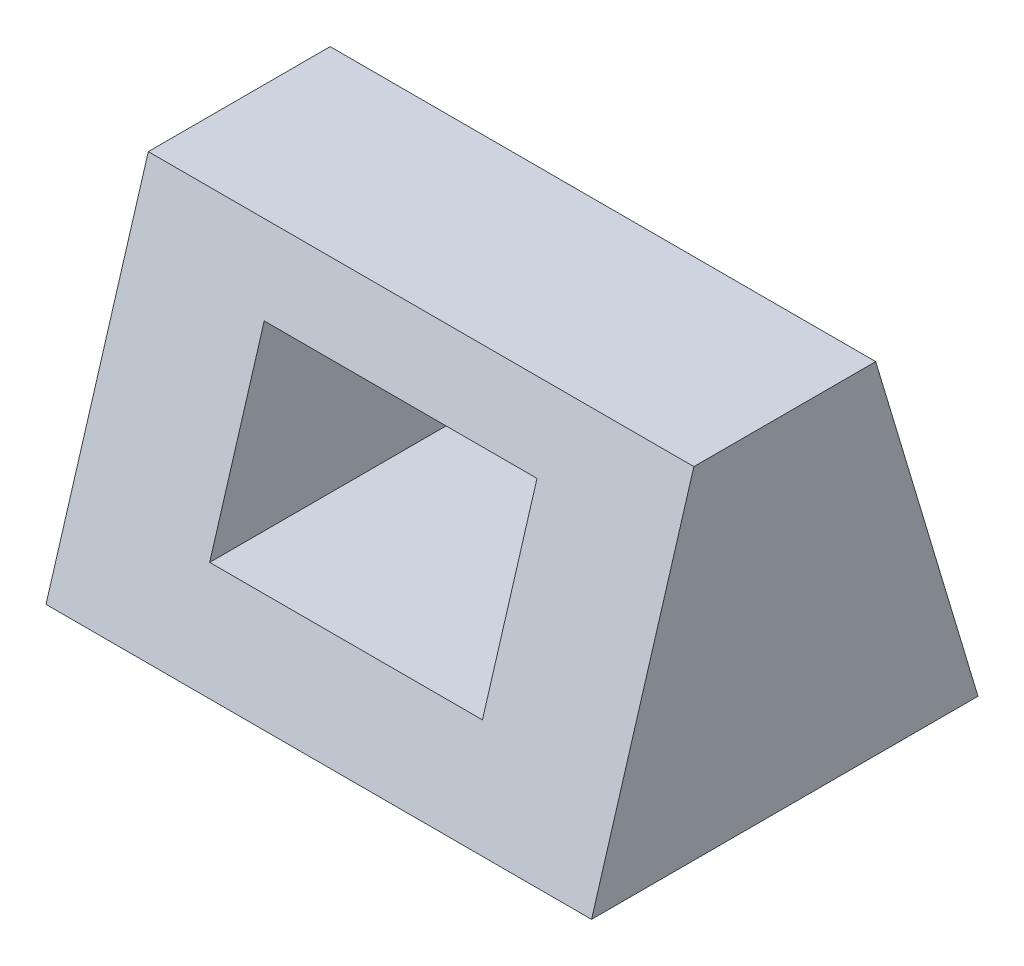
ISO-10303-21;
HEADER;
FILE_DESCRIPTION(('STEP AP214'),'2;1');
FILE_NAME('part.step','',(''),(''),'','','');
FILE_SCHEMA(('AUTOMOTIVE_DESIGN { 1 0 10303 214 1 1 1 1 }'));
ENDSEC;
DATA;
#1=APPLICATION_CONTEXT('core data for automotive mechanical design processes');
#2=APPLICATION_PROTOCOL_DEFINITION('international standard','automotive_design',2000,#1);
#3=PRODUCT_CONTEXT('',#1,'mechanical');
#4=PRODUCT('Part','Part','',(#3));
#5=PRODUCT_RELATED_PRODUCT_CATEGORY('part','',(#4));
#6=PRODUCT_DEFINITION_FORMATION('','',#4);
#7=PRODUCT_DEFINITION_CONTEXT('part definition',#1,'design');
#8=PRODUCT_DEFINITION('design','',#6,#7);
#9=PRODUCT_DEFINITION_SHAPE('','',#8);
#10=(LENGTH_UNIT() NAMED_UNIT(*) SI_UNIT(.MILLI.,.METRE.));
#11=(NAMED_UNIT(*) PLANE_ANGLE_UNIT() SI_UNIT($,.RADIAN.));
#12=(NAMED_UNIT(*) SI_UNIT($,.STERADIAN.) SOLID_ANGLE_UNIT());
#13=UNCERTAINTY_MEASURE_WITH_UNIT(LENGTH_MEASURE(1.E-05),#10,'distance_accuracy_value','');
#14=(GEOMETRIC_REPRESENTATION_CONTEXT(3) GLOBAL_UNCERTAINTY_ASSIGNED_CONTEXT((#13)) GLOBAL_UNIT_ASSIGNED_CONTEXT((#10,
#11,#12)) REPRESENTATION_CONTEXT('',''));
#15=CARTESIAN_POINT('',(0.,0.,0.));
#16=DIRECTION('',(0.,0.,1.));
#17=DIRECTION('',(1.,0.,0.));
#18=AXIS2_PLACEMENT_3D('',#15,#16,#17);
#19=CARTESIAN_POINT('',(120.,75.,20.));
#20=DIRECTION('',(0.,-0.287347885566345,-0.957826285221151));
#21=DIRECTION('',(0.,0.957826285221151,-0.287347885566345));
#22=AXIS2_PLACEMENT_3D('',#19,#20,#21);
#23=PLANE('',#22);
#24=DIRECTION('',(0.,-0.957826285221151,0.287347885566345));
#25=VECTOR('',#24,1.);
#26=CARTESIAN_POINT('',(0.,75.,20.));
#27=LINE('',#26,#25);
#28=CARTESIAN_POINT('',(0.,75.,20.));
#29=VERTEX_POINT('',#28);
#30=CARTESIAN_POINT('',(0.,0.,42.5));
#31=VERTEX_POINT('',#30);
#32=EDGE_CURVE('E131',#29,#31,#27,.T.);
#33=ORIENTED_EDGE('',*,*,#32,.T.);
#34=DIRECTION('',(-1.,0.,0.));
#35=VECTOR('',#34,1.);
#36=CARTESIAN_POINT('',(120.,0.,42.5));
#37=LINE('',#36,#35);
#38=CARTESIAN_POINT('',(120.,0.,42.5));
#39=VERTEX_POINT('',#38);
#40=EDGE_CURVE('E97',#39,#31,#37,.T.);
#41=ORIENTED_EDGE('',*,*,#40,.F.);
#42=DIRECTION('',(0.,-0.957826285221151,0.287347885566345));
#43=VECTOR('',#42,1.);
#44=CARTESIAN_POINT('',(120.,75.,20.));
#45=LINE('',#44,#43);
#46=CARTESIAN_POINT('',(120.,75.,20.));
#47=VERTEX_POINT('',#46);
#48=EDGE_CURVE('E126',#47,#39,#45,.T.);
#49=ORIENTED_EDGE('',*,*,#48,.F.);
#50=DIRECTION('',(-1.,0.,0.));
#51=VECTOR('',#50,1.);
#52=CARTESIAN_POINT('',(120.,75.,20.));
#53=LINE('',#52,#51);
#54=EDGE_CURVE('E120',#47,#29,#53,.T.);
#55=ORIENTED_EDGE('',*,*,#54,.T.);
#56=EDGE_LOOP('',(#33,#41,#49,#55));
#57=FACE_BOUND('',#56,.T.);
#58=DIRECTION('',(0.,-0.957826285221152,0.287347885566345));
#59=VECTOR('',#58,1.);
#60=CARTESIAN_POINT('',(30.,75.,20.));
#61=LINE('',#60,#59);
#62=CARTESIAN_POINT('',(30.,60.,24.5));
#63=VERTEX_POINT('',#62);
#64=CARTESIAN_POINT('',(30.,20.,36.5));
#65=VERTEX_POINT('',#64);
#66=EDGE_CURVE('E134',#63,#65,#61,.T.);
#67=ORIENTED_EDGE('',*,*,#66,.F.);
#68=DIRECTION('',(-1.,0.,0.));
#69=VECTOR('',#68,1.);
#70=CARTESIAN_POINT('',(120.,60.,24.5));
#71=LINE('',#70,#69);
#72=CARTESIAN_POINT('',(90.,60.,24.5));
#73=VERTEX_POINT('',#72);
#74=EDGE_CURVE('E146',#73,#63,#71,.T.);
#75=ORIENTED_EDGE('',*,*,#74,.F.);
#76=DIRECTION('',(0.,0.957826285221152,-0.287347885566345));
#77=VECTOR('',#76,1.);
#78=CARTESIAN_POINT('',(90.,75.,20.));
#79=LINE('',#78,#77);
#80=CARTESIAN_POINT('',(90.,20.,36.5));
#81=VERTEX_POINT('',#80);
#82=EDGE_CURVE('E104',#81,#73,#79,.T.);
#83=ORIENTED_EDGE('',*,*,#82,.F.);
#84=DIRECTION('',(1.,0.,0.));
#85=VECTOR('',#84,1.);
#86=CARTESIAN_POINT('',(120.,20.,36.5));
#87=LINE('',#86,#85);
#88=EDGE_CURVE('E143',#65,#81,#87,.T.);
#89=ORIENTED_EDGE('',*,*,#88,.F.);
#90=EDGE_LOOP('',(#67,#75,#83,#89));
#91=FACE_BOUND('',#90,.T.);
#92=ADVANCED_FACE('F31',(#57,#91),#23,.F.);
#93=CARTESIAN_POINT('',(120.,0.,-42.5));
#94=DIRECTION('',(0.,-0.287347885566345,0.957826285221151));
#95=DIRECTION('',(0.,-0.957826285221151,-0.287347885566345));
#96=AXIS2_PLACEMENT_3D('',#93,#94,#95);
#97=PLANE('',#96);
#98=DIRECTION('',(0.,0.957826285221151,0.287347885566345));
#99=VECTOR('',#98,1.);
#100=CARTESIAN_POINT('',(0.,0.,-42.5));
#101=LINE('',#100,#99);
#102=CARTESIAN_POINT('',(0.,0.,-42.5));
#103=VERTEX_POINT('',#102);
#104=CARTESIAN_POINT('',(0.,75.,-20.));
#105=VERTEX_POINT('',#104);
#106=EDGE_CURVE('E127',#103,#105,#101,.T.);
#107=ORIENTED_EDGE('',*,*,#106,.T.);
#108=DIRECTION('',(-1.,0.,0.));
#109=VECTOR('',#108,1.);
#110=CARTESIAN_POINT('',(120.,75.,-20.));
#111=LINE('',#110,#109);
#112=CARTESIAN_POINT('',(120.,75.,-20.));
#113=VERTEX_POINT('',#112);
#114=EDGE_CURVE('E117',#113,#105,#111,.T.);
#115=ORIENTED_EDGE('',*,*,#114,.F.);
#116=DIRECTION('',(0.,0.957826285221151,0.287347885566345));
#117=VECTOR('',#116,1.);
#118=CARTESIAN_POINT('',(120.,0.,-42.5));
#119=LINE('',#118,#117);
#120=CARTESIAN_POINT('',(120.,0.,-42.5));
#121=VERTEX_POINT('',#120);
#122=EDGE_CURVE('E136',#121,#113,#119,.T.);
#123=ORIENTED_EDGE('',*,*,#122,.F.);
#124=DIRECTION('',(-1.,0.,0.));
#125=VECTOR('',#124,1.);
#126=CARTESIAN_POINT('',(120.,0.,-42.5));
#127=LINE('',#126,#125);
#128=EDGE_CURVE('E114',#121,#103,#127,.T.);
#129=ORIENTED_EDGE('',*,*,#128,.T.);
#130=EDGE_LOOP('',(#107,#115,#123,#129));
#131=FACE_BOUND('',#130,.T.);
#132=DIRECTION('',(0.,0.957826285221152,0.287347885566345));
#133=VECTOR('',#132,1.);
#134=CARTESIAN_POINT('',(30.,0.,-42.5));
#135=LINE('',#134,#133);
#136=CARTESIAN_POINT('',(30.,20.,-36.5));
#137=VERTEX_POINT('',#136);
#138=CARTESIAN_POINT('',(30.,60.,-24.5));
#139=VERTEX_POINT('',#138);
#140=EDGE_CURVE('E11',#137,#139,#135,.T.);
#141=ORIENTED_EDGE('',*,*,#140,.F.);
#142=DIRECTION('',(-1.,0.,0.));
#143=VECTOR('',#142,1.);
#144=CARTESIAN_POINT('',(120.,20.,-36.5));
#145=LINE('',#144,#143);
#146=CARTESIAN_POINT('',(90.,20.,-36.5));
#147=VERTEX_POINT('',#146);
#148=EDGE_CURVE('E38',#147,#137,#145,.T.);
#149=ORIENTED_EDGE('',*,*,#148,.F.);
#150=DIRECTION('',(0.,-0.957826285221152,-0.287347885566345));
#151=VECTOR('',#150,1.);
#152=CARTESIAN_POINT('',(90.,0.,-42.5));
#153=LINE('',#152,#151);
#154=CARTESIAN_POINT('',(90.,60.,-24.5));
#155=VERTEX_POINT('',#154);
#156=EDGE_CURVE('E96',#155,#147,#153,.T.);
#157=ORIENTED_EDGE('',*,*,#156,.F.);
#158=DIRECTION('',(1.,0.,0.));
#159=VECTOR('',#158,1.);
#160=CARTESIAN_POINT('',(120.,60.,-24.5));
#161=LINE('',#160,#159);
#162=EDGE_CURVE('E91',#139,#155,#161,.T.);
#163=ORIENTED_EDGE('',*,*,#162,.F.);
#164=EDGE_LOOP('',(#141,#149,#157,#163));
#165=FACE_BOUND('',#164,.T.);
#166=ADVANCED_FACE('F109',(#131,#165),#97,.F.);
#167=CARTESIAN_POINT('',(120.,0.,42.5));
#168=DIRECTION('',(0.,1.,0.));
#169=DIRECTION('',(0.,0.,1.));
#170=AXIS2_PLACEMENT_3D('',#167,#168,#169);
#171=PLANE('',#170);
#172=DIRECTION('',(0.,0.,-1.));
#173=VECTOR('',#172,1.);
#174=CARTESIAN_POINT('',(0.,0.,42.5));
#175=LINE('',#174,#173);
#176=EDGE_CURVE('E129',#31,#103,#175,.T.);
#177=ORIENTED_EDGE('',*,*,#176,.T.);
#178=ORIENTED_EDGE('',*,*,#128,.F.);
#179=DIRECTION('',(0.,0.,-1.));
#180=VECTOR('',#179,1.);
#181=CARTESIAN_POINT('',(120.,0.,42.5));
#182=LINE('',#181,#180);
#183=EDGE_CURVE('E138',#39,#121,#182,.T.);
#184=ORIENTED_EDGE('',*,*,#183,.F.);
#185=ORIENTED_EDGE('',*,*,#40,.T.);
#186=EDGE_LOOP('',(#177,#178,#184,#185));
#187=FACE_BOUND('',#186,.T.);
#188=ADVANCED_FACE('F177',(#187),#171,.F.);
#189=CARTESIAN_POINT('',(120.,75.,-20.));
#190=DIRECTION('',(0.,-1.,0.));
#191=DIRECTION('',(0.,0.,-1.));
#192=AXIS2_PLACEMENT_3D('',#189,#190,#191);
#193=PLANE('',#192);
#194=DIRECTION('',(0.,0.,1.));
#195=VECTOR('',#194,1.);
#196=CARTESIAN_POINT('',(0.,75.,-20.));
#197=LINE('',#196,#195);
#198=EDGE_CURVE('E124',#105,#29,#197,.T.);
#199=ORIENTED_EDGE('',*,*,#198,.T.);
#200=ORIENTED_EDGE('',*,*,#54,.F.);
#201=DIRECTION('',(0.,0.,1.));
#202=VECTOR('',#201,1.);
#203=CARTESIAN_POINT('',(120.,75.,-20.));
#204=LINE('',#203,#202);
#205=EDGE_CURVE('E123',#113,#47,#204,.T.);
#206=ORIENTED_EDGE('',*,*,#205,.F.);
#207=ORIENTED_EDGE('',*,*,#114,.T.);
#208=EDGE_LOOP('',(#199,#200,#206,#207));
#209=FACE_BOUND('',#208,.T.);
#210=ADVANCED_FACE('F193',(#209),#193,.F.);
#211=CARTESIAN_POINT('',(120.,0.,42.5));
#212=DIRECTION('',(1.,0.,0.));
#213=DIRECTION('',(0.,0.,-1.));
#214=AXIS2_PLACEMENT_3D('',#211,#212,#213);
#215=PLANE('',#214);
#216=ORIENTED_EDGE('',*,*,#48,.T.);
#217=ORIENTED_EDGE('',*,*,#183,.T.);
#218=ORIENTED_EDGE('',*,*,#122,.T.);
#219=ORIENTED_EDGE('',*,*,#205,.T.);
#220=EDGE_LOOP('',(#216,#217,#218,#219));
#221=FACE_BOUND('',#220,.T.);
#222=ADVANCED_FACE('F168',(#221),#215,.T.);
#223=CARTESIAN_POINT('',(0.,0.,42.5));
#224=DIRECTION('',(1.,0.,0.));
#225=DIRECTION('',(0.,0.,-1.));
#226=AXIS2_PLACEMENT_3D('',#223,#224,#225);
#227=PLANE('',#226);
#228=ORIENTED_EDGE('',*,*,#32,.F.);
#229=ORIENTED_EDGE('',*,*,#198,.F.);
#230=ORIENTED_EDGE('',*,*,#106,.F.);
#231=ORIENTED_EDGE('',*,*,#176,.F.);
#232=EDGE_LOOP('',(#228,#229,#230,#231));
#233=FACE_BOUND('',#232,.T.);
#234=ADVANCED_FACE('F161',(#233),#227,.F.);
#235=CARTESIAN_POINT('',(30.,60.,98.));
#236=DIRECTION('',(1.,0.,0.));
#237=DIRECTION('',(0.,1.,0.));
#238=AXIS2_PLACEMENT_3D('',#235,#236,#237);
#239=PLANE('',#238);
#240=ORIENTED_EDGE('',*,*,#66,.T.);
#241=DIRECTION('',(0.,0.,-1.));
#242=VECTOR('',#241,1.);
#243=CARTESIAN_POINT('',(30.,20.,98.));
#244=LINE('',#243,#242);
#245=EDGE_CURVE('E148',#65,#137,#244,.T.);
#246=ORIENTED_EDGE('',*,*,#245,.T.);
#247=ORIENTED_EDGE('',*,*,#140,.T.);
#248=DIRECTION('',(0.,0.,-1.));
#249=VECTOR('',#248,1.);
#250=CARTESIAN_POINT('',(30.,60.,98.));
#251=LINE('',#250,#249);
#252=EDGE_CURVE('E50',#63,#139,#251,.T.);
#253=ORIENTED_EDGE('',*,*,#252,.F.);
#254=EDGE_LOOP('',(#240,#246,#247,#253));
#255=FACE_BOUND('',#254,.T.);
#256=ADVANCED_FACE('F159',(#255),#239,.T.);
#257=CARTESIAN_POINT('',(30.,20.,98.));
#258=DIRECTION('',(0.,1.,0.));
#259=DIRECTION('',(0.,0.,1.));
#260=AXIS2_PLACEMENT_3D('',#257,#258,#259);
#261=PLANE('',#260);
#262=ORIENTED_EDGE('',*,*,#88,.T.);
#263=DIRECTION('',(0.,0.,-1.));
#264=VECTOR('',#263,1.);
#265=CARTESIAN_POINT('',(90.,20.,98.));
#266=LINE('',#265,#264);
#267=EDGE_CURVE('E106',#81,#147,#266,.T.);
#268=ORIENTED_EDGE('',*,*,#267,.T.);
#269=ORIENTED_EDGE('',*,*,#148,.T.);
#270=ORIENTED_EDGE('',*,*,#245,.F.);
#271=EDGE_LOOP('',(#262,#268,#269,#270));
#272=FACE_BOUND('',#271,.T.);
#273=ADVANCED_FACE('F153',(#272),#261,.T.);
#274=CARTESIAN_POINT('',(90.,60.,98.));
#275=DIRECTION('',(-1.,0.,0.));
#276=DIRECTION('',(0.,0.,1.));
#277=AXIS2_PLACEMENT_3D('',#274,#275,#276);
#278=PLANE('',#277);
#279=ORIENTED_EDGE('',*,*,#82,.T.);
#280=DIRECTION('',(0.,0.,-1.));
#281=VECTOR('',#280,1.);
#282=CARTESIAN_POINT('',(90.,60.,98.));
#283=LINE('',#282,#281);
#284=EDGE_CURVE('E45',#73,#155,#283,.T.);
#285=ORIENTED_EDGE('',*,*,#284,.T.);
#286=ORIENTED_EDGE('',*,*,#156,.T.);
#287=ORIENTED_EDGE('',*,*,#267,.F.);
#288=EDGE_LOOP('',(#279,#285,#286,#287));
#289=FACE_BOUND('',#288,.T.);
#290=ADVANCED_FACE('F100',(#289),#278,.T.);
#291=CARTESIAN_POINT('',(30.,60.,98.));
#292=DIRECTION('',(0.,-1.,0.));
#293=DIRECTION('',(0.,0.,-1.));
#294=AXIS2_PLACEMENT_3D('',#291,#292,#293);
#295=PLANE('',#294);
#296=ORIENTED_EDGE('',*,*,#74,.T.);
#297=ORIENTED_EDGE('',*,*,#252,.T.);
#298=ORIENTED_EDGE('',*,*,#162,.T.);
#299=ORIENTED_EDGE('',*,*,#284,.F.);
#300=EDGE_LOOP('',(#296,#297,#298,#299));
#301=FACE_BOUND('',#300,.T.);
#302=ADVANCED_FACE('F92',(#301),#295,.T.);
#303=CLOSED_SHELL('',(#92,#166,#188,#210,#222,#234,#256,#273,#290,#302));
#304=MANIFOLD_SOLID_BREP('B2',#303);
#305=ADVANCED_BREP_SHAPE_REPRESENTATION('',(#18,#304),#14);
#306=SHAPE_DEFINITION_REPRESENTATION(#9,#305);
ENDSEC;
END-ISO-10303-21;
